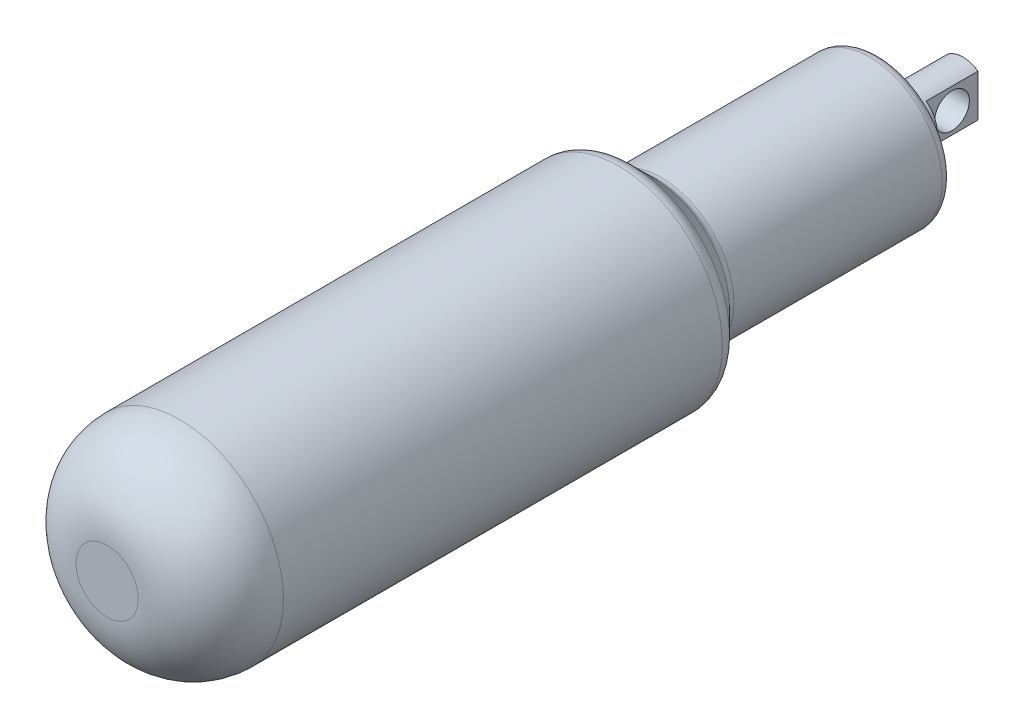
ISO-10303-21;
HEADER;
FILE_DESCRIPTION(('STEP AP214'),'2;1');
FILE_NAME('part.step','',(''),(''),'','','');
FILE_SCHEMA(('AUTOMOTIVE_DESIGN { 1 0 10303 214 1 1 1 1 }'));
ENDSEC;
DATA;
#1=APPLICATION_CONTEXT('core data for automotive mechanical design processes');
#2=APPLICATION_PROTOCOL_DEFINITION('international standard','automotive_design',2000,#1);
#3=PRODUCT_CONTEXT('',#1,'mechanical');
#4=PRODUCT('Part','Part','',(#3));
#5=PRODUCT_RELATED_PRODUCT_CATEGORY('part','',(#4));
#6=PRODUCT_DEFINITION_FORMATION('','',#4);
#7=PRODUCT_DEFINITION_CONTEXT('part definition',#1,'design');
#8=PRODUCT_DEFINITION('design','',#6,#7);
#9=PRODUCT_DEFINITION_SHAPE('','',#8);
#10=(LENGTH_UNIT() NAMED_UNIT(*) SI_UNIT(.MILLI.,.METRE.));
#11=(NAMED_UNIT(*) PLANE_ANGLE_UNIT() SI_UNIT($,.RADIAN.));
#12=(NAMED_UNIT(*) SI_UNIT($,.STERADIAN.) SOLID_ANGLE_UNIT());
#13=UNCERTAINTY_MEASURE_WITH_UNIT(LENGTH_MEASURE(1.E-05),#10,'distance_accuracy_value','');
#14=(GEOMETRIC_REPRESENTATION_CONTEXT(3) GLOBAL_UNCERTAINTY_ASSIGNED_CONTEXT((#13)) GLOBAL_UNIT_ASSIGNED_CONTEXT((#10,
#11,#12)) REPRESENTATION_CONTEXT('',''));
#15=CARTESIAN_POINT('',(0.,0.,0.));
#16=DIRECTION('',(0.,0.,1.));
#17=DIRECTION('',(1.,0.,0.));
#18=AXIS2_PLACEMENT_3D('',#15,#16,#17);
#19=CARTESIAN_POINT('',(0.,0.,-2.999994));
#20=DIRECTION('',(0.,0.,1.));
#21=DIRECTION('',(1.,0.,0.));
#22=AXIS2_PLACEMENT_3D('',#19,#20,#21);
#23=CYLINDRICAL_SURFACE('',#22,2.99999997);
#24=CARTESIAN_POINT('',(0.,0.,6.600006));
#25=DIRECTION('',(0.,0.,1.));
#26=DIRECTION('',(1.,0.,0.));
#27=AXIS2_PLACEMENT_3D('',#24,#25,#26);
#28=CIRCLE('',#27,2.99999997);
#29=CARTESIAN_POINT('',(2.99999997,0.,6.600006));
#30=VERTEX_POINT('',#29);
#31=EDGE_CURVE('E99',#30,#30,#28,.T.);
#32=ORIENTED_EDGE('',*,*,#31,.F.);
#33=EDGE_LOOP('',(#32));
#34=FACE_BOUND('',#33,.T.);
#35=DIRECTION('',(0.,0.,1.));
#36=VECTOR('',#35,1.);
#37=CARTESIAN_POINT('',(-1.7322836,-2.4493250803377,-2.999994));
#38=LINE('',#37,#36);
#39=CARTESIAN_POINT('',(-1.7322836,-2.4493250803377,-2.999994));
#40=VERTEX_POINT('',#39);
#41=CARTESIAN_POINT('',(-1.7322836,-2.4493250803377,3.00000438));
#42=VERTEX_POINT('',#41);
#43=EDGE_CURVE('E105',#40,#42,#38,.T.);
#44=ORIENTED_EDGE('',*,*,#43,.F.);
#45=CARTESIAN_POINT('',(0.,0.,-2.999994));
#46=DIRECTION('',(0.,0.,1.));
#47=DIRECTION('',(1.,0.,0.));
#48=AXIS2_PLACEMENT_3D('',#45,#46,#47);
#49=CIRCLE('',#48,2.99999997);
#50=CARTESIAN_POINT('',(1.7322836,-2.4493250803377,-2.999994));
#51=VERTEX_POINT('',#50);
#52=EDGE_CURVE('E104',#40,#51,#49,.T.);
#53=ORIENTED_EDGE('',*,*,#52,.T.);
#54=DIRECTION('',(0.,0.,1.));
#55=VECTOR('',#54,1.);
#56=CARTESIAN_POINT('',(1.7322836,-2.4493250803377,-2.999994));
#57=LINE('',#56,#55);
#58=CARTESIAN_POINT('',(1.7322836,-2.4493250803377,3.00000438));
#59=VERTEX_POINT('',#58);
#60=EDGE_CURVE('E29',#59,#51,#57,.F.);
#61=ORIENTED_EDGE('',*,*,#60,.F.);
#62=CARTESIAN_POINT('',(0.,0.,3.00000438));
#63=DIRECTION('',(0.,0.,-1.));
#64=DIRECTION('',(-1.,0.,0.));
#65=AXIS2_PLACEMENT_3D('',#62,#63,#64);
#66=CIRCLE('',#65,2.99999997);
#67=CARTESIAN_POINT('',(1.7322836,2.4493250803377,3.00000438));
#68=VERTEX_POINT('',#67);
#69=EDGE_CURVE('E22',#68,#59,#66,.T.);
#70=ORIENTED_EDGE('',*,*,#69,.F.);
#71=DIRECTION('',(0.,0.,1.));
#72=VECTOR('',#71,1.);
#73=CARTESIAN_POINT('',(1.7322836,2.4493250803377,-2.999994));
#74=LINE('',#73,#72);
#75=CARTESIAN_POINT('',(1.7322836,2.4493250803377,-2.999994));
#76=VERTEX_POINT('',#75);
#77=EDGE_CURVE('E54',#76,#68,#74,.T.);
#78=ORIENTED_EDGE('',*,*,#77,.F.);
#79=CARTESIAN_POINT('',(-1.7322836,2.4493250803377,-2.999994));
#80=VERTEX_POINT('',#79);
#81=EDGE_CURVE('E102',#76,#80,#49,.T.);
#82=ORIENTED_EDGE('',*,*,#81,.T.);
#83=DIRECTION('',(0.,0.,1.));
#84=VECTOR('',#83,1.);
#85=CARTESIAN_POINT('',(-1.7322836,2.4493250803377,-2.999994));
#86=LINE('',#85,#84);
#87=CARTESIAN_POINT('',(-1.7322836,2.4493250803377,3.00000438));
#88=VERTEX_POINT('',#87);
#89=EDGE_CURVE('E37',#88,#80,#86,.F.);
#90=ORIENTED_EDGE('',*,*,#89,.F.);
#91=CARTESIAN_POINT('',(0.,0.,3.00000438));
#92=DIRECTION('',(0.,0.,-1.));
#93=DIRECTION('',(-1.,0.,0.));
#94=AXIS2_PLACEMENT_3D('',#91,#92,#93);
#95=CIRCLE('',#94,2.99999997);
#96=EDGE_CURVE('E9',#42,#88,#95,.T.);
#97=ORIENTED_EDGE('',*,*,#96,.F.);
#98=EDGE_LOOP('',(#44,#53,#61,#70,#78,#82,#90,#97));
#99=FACE_BOUND('',#98,.T.);
#100=ADVANCED_FACE('F14',(#34,#99),#23,.T.);
#101=CARTESIAN_POINT('',(0.,2.99999997,-2.999994));
#102=DIRECTION('',(0.,0.,1.));
#103=DIRECTION('',(1.,0.,0.));
#104=AXIS2_PLACEMENT_3D('',#101,#102,#103);
#105=PLANE('',#104);
#106=DIRECTION('',(0.,-1.,0.));
#107=VECTOR('',#106,1.);
#108=CARTESIAN_POINT('',(-1.7322836,2.99999997,-2.999994));
#109=LINE('',#108,#107);
#110=EDGE_CURVE('E71',#80,#40,#109,.T.);
#111=ORIENTED_EDGE('',*,*,#110,.F.);
#112=ORIENTED_EDGE('',*,*,#81,.F.);
#113=DIRECTION('',(0.,1.,0.));
#114=VECTOR('',#113,1.);
#115=CARTESIAN_POINT('',(1.7322836,2.99999997,-2.999994));
#116=LINE('',#115,#114);
#117=EDGE_CURVE('E58',#51,#76,#116,.T.);
#118=ORIENTED_EDGE('',*,*,#117,.F.);
#119=ORIENTED_EDGE('',*,*,#52,.F.);
#120=EDGE_LOOP('',(#111,#112,#118,#119));
#121=FACE_BOUND('',#120,.T.);
#122=ADVANCED_FACE('F127',(#121),#105,.F.);
#123=CARTESIAN_POINT('',(0.,0.,96.00000324));
#124=DIRECTION('',(0.,0.,-1.));
#125=DIRECTION('',(-1.,0.,0.));
#126=AXIS2_PLACEMENT_3D('',#123,#124,#125);
#127=PLANE('',#126);
#128=CARTESIAN_POINT('',(0.,0.,96.00000324));
#129=DIRECTION('',(0.,0.,1.));
#130=DIRECTION('',(1.,0.,0.));
#131=AXIS2_PLACEMENT_3D('',#128,#129,#130);
#132=CIRCLE('',#131,3.600000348);
#133=CARTESIAN_POINT('',(3.600000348,0.,96.00000324));
#134=VERTEX_POINT('',#133);
#135=EDGE_CURVE('E75',#134,#134,#132,.T.);
#136=ORIENTED_EDGE('',*,*,#135,.T.);
#137=EDGE_LOOP('',(#136));
#138=FACE_BOUND('',#137,.T.);
#139=ADVANCED_FACE('F16',(#138),#127,.F.);
#140=CARTESIAN_POINT('',(0.,0.,87.600003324));
#141=DIRECTION('',(0.,0.,1.));
#142=DIRECTION('',(1.,0.,0.));
#143=AXIS2_PLACEMENT_3D('',#140,#141,#142);
#144=DEGENERATE_TOROIDAL_SURFACE('',#143,3.60000034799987,8.39999991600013,.T.);
#145=ORIENTED_EDGE('',*,*,#135,.F.);
#146=EDGE_LOOP('',(#145));
#147=FACE_BOUND('',#146,.T.);
#148=CARTESIAN_POINT('',(0.,0.,87.600003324));
#149=DIRECTION('',(0.,0.,1.));
#150=DIRECTION('',(1.,0.,0.));
#151=AXIS2_PLACEMENT_3D('',#148,#149,#150);
#152=CIRCLE('',#151,12.000000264);
#153=CARTESIAN_POINT('',(12.000000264,0.,87.600003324));
#154=VERTEX_POINT('',#153);
#155=EDGE_CURVE('E78',#154,#154,#152,.T.);
#156=ORIENTED_EDGE('',*,*,#155,.T.);
#157=EDGE_LOOP('',(#156));
#158=FACE_BOUND('',#157,.T.);
#159=ADVANCED_FACE('F136',(#147,#158),#144,.T.);
#160=CARTESIAN_POINT('',(0.,0.,-2.999994));
#161=DIRECTION('',(0.,0.,1.));
#162=DIRECTION('',(1.,0.,0.));
#163=AXIS2_PLACEMENT_3D('',#160,#161,#162);
#164=CYLINDRICAL_SURFACE('',#163,12.000000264);
#165=ORIENTED_EDGE('',*,*,#155,.F.);
#166=EDGE_LOOP('',(#165));
#167=FACE_BOUND('',#166,.T.);
#168=CARTESIAN_POINT('',(0.,0.,36.828430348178));
#169=DIRECTION('',(0.,0.,1.));
#170=DIRECTION('',(1.,0.,0.));
#171=AXIS2_PLACEMENT_3D('',#168,#169,#170);
#172=CIRCLE('',#171,12.000000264);
#173=CARTESIAN_POINT('',(12.000000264,0.,36.828430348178));
#174=VERTEX_POINT('',#173);
#175=EDGE_CURVE('E81',#174,#174,#172,.T.);
#176=ORIENTED_EDGE('',*,*,#175,.T.);
#177=EDGE_LOOP('',(#176));
#178=FACE_BOUND('',#177,.T.);
#179=ADVANCED_FACE('F165',(#167,#178),#164,.T.);
#180=CARTESIAN_POINT('',(0.,0.,36.8284303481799));
#181=DIRECTION('',(0.,0.,1.));
#182=DIRECTION('',(1.,0.,0.));
#183=AXIS2_PLACEMENT_3D('',#180,#181,#182);
#184=TOROIDAL_SURFACE('',#183,10.0000003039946,1.99999996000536);
#185=ORIENTED_EDGE('',*,*,#175,.F.);
#186=EDGE_LOOP('',(#185));
#187=FACE_BOUND('',#186,.T.);
#188=CARTESIAN_POINT('',(0.,0.,35.414216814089));
#189=DIRECTION('',(0.,0.,1.));
#190=DIRECTION('',(1.,0.,0.));
#191=AXIS2_PLACEMENT_3D('',#188,#189,#190);
#192=CIRCLE('',#191,11.414213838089);
#193=CARTESIAN_POINT('',(11.414213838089,0.,35.414216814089));
#194=VERTEX_POINT('',#193);
#195=EDGE_CURVE('E84',#194,#194,#192,.T.);
#196=ORIENTED_EDGE('',*,*,#195,.T.);
#197=EDGE_LOOP('',(#196));
#198=FACE_BOUND('',#197,.T.);
#199=ADVANCED_FACE('F161',(#187,#198),#184,.T.);
#200=CARTESIAN_POINT('',(0.,0.,32.751474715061));
#201=DIRECTION('',(0.,0.,1.));
#202=DIRECTION('',(1.,0.,0.));
#203=AXIS2_PLACEMENT_3D('',#200,#201,#202);
#204=CONICAL_SURFACE('',#203,8.751471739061,0.785398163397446);
#205=ORIENTED_EDGE('',*,*,#195,.F.);
#206=EDGE_LOOP('',(#205));
#207=FACE_BOUND('',#206,.T.);
#208=CARTESIAN_POINT('',(0.,0.,32.751474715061));
#209=DIRECTION('',(0.,0.,1.));
#210=DIRECTION('',(1.,0.,0.));
#211=AXIS2_PLACEMENT_3D('',#208,#209,#210);
#212=CIRCLE('',#211,8.751471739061);
#213=CARTESIAN_POINT('',(8.751471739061,0.,32.751474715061));
#214=VERTEX_POINT('',#213);
#215=EDGE_CURVE('E87',#214,#214,#212,.T.);
#216=ORIENTED_EDGE('',*,*,#215,.T.);
#217=EDGE_LOOP('',(#216));
#218=FACE_BOUND('',#217,.T.);
#219=ADVANCED_FACE('F157',(#207,#218),#204,.T.);
#220=CARTESIAN_POINT('',(0.,0.,31.9029465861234));
#221=DIRECTION('',(0.,0.,1.));
#222=DIRECTION('',(1.,0.,0.));
#223=AXIS2_PLACEMENT_3D('',#220,#221,#222);
#224=TOROIDAL_SURFACE('',#223,9.59999986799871,1.19999998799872);
#225=ORIENTED_EDGE('',*,*,#215,.F.);
#226=EDGE_LOOP('',(#225));
#227=FACE_BOUND('',#226,.T.);
#228=CARTESIAN_POINT('',(0.,0.,31.902946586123));
#229=DIRECTION('',(0.,0.,1.));
#230=DIRECTION('',(1.,0.,0.));
#231=AXIS2_PLACEMENT_3D('',#228,#229,#230);
#232=CIRCLE('',#231,8.39999988);
#233=CARTESIAN_POINT('',(8.39999988,0.,31.902946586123));
#234=VERTEX_POINT('',#233);
#235=EDGE_CURVE('E90',#234,#234,#232,.T.);
#236=ORIENTED_EDGE('',*,*,#235,.T.);
#237=EDGE_LOOP('',(#236));
#238=FACE_BOUND('',#237,.T.);
#239=ADVANCED_FACE('F153',(#227,#238),#224,.F.);
#240=CARTESIAN_POINT('',(0.,0.,-2.999994));
#241=DIRECTION('',(0.,0.,1.));
#242=DIRECTION('',(1.,0.,0.));
#243=AXIS2_PLACEMENT_3D('',#240,#241,#242);
#244=CYLINDRICAL_SURFACE('',#243,8.39999988);
#245=ORIENTED_EDGE('',*,*,#235,.F.);
#246=EDGE_LOOP('',(#245));
#247=FACE_BOUND('',#246,.T.);
#248=CARTESIAN_POINT('',(0.,0.,7.80000598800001));
#249=DIRECTION('',(0.,0.,1.));
#250=DIRECTION('',(1.,0.,0.));
#251=AXIS2_PLACEMENT_3D('',#248,#249,#250);
#252=CIRCLE('',#251,8.39999988);
#253=CARTESIAN_POINT('',(8.39999988,0.,7.80000598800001));
#254=VERTEX_POINT('',#253);
#255=EDGE_CURVE('E93',#254,#254,#252,.T.);
#256=ORIENTED_EDGE('',*,*,#255,.T.);
#257=EDGE_LOOP('',(#256));
#258=FACE_BOUND('',#257,.T.);
#259=ADVANCED_FACE('F149',(#247,#258),#244,.T.);
#260=CARTESIAN_POINT('',(0.,0.,7.80000598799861));
#261=DIRECTION('',(0.,0.,1.));
#262=DIRECTION('',(1.,0.,0.));
#263=AXIS2_PLACEMENT_3D('',#260,#261,#262);
#264=TOROIDAL_SURFACE('',#263,7.19999989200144,1.19999998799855);
#265=ORIENTED_EDGE('',*,*,#255,.F.);
#266=EDGE_LOOP('',(#265));
#267=FACE_BOUND('',#266,.T.);
#268=CARTESIAN_POINT('',(0.,0.,6.600006));
#269=DIRECTION('',(0.,0.,1.));
#270=DIRECTION('',(1.,0.,0.));
#271=AXIS2_PLACEMENT_3D('',#268,#269,#270);
#272=CIRCLE('',#271,7.199999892);
#273=CARTESIAN_POINT('',(7.199999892,0.,6.600006));
#274=VERTEX_POINT('',#273);
#275=EDGE_CURVE('E96',#274,#274,#272,.T.);
#276=ORIENTED_EDGE('',*,*,#275,.T.);
#277=EDGE_LOOP('',(#276));
#278=FACE_BOUND('',#277,.T.);
#279=ADVANCED_FACE('F145',(#267,#278),#264,.T.);
#280=CARTESIAN_POINT('',(0.,7.199999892,6.600006));
#281=DIRECTION('',(0.,0.,1.));
#282=DIRECTION('',(1.,0.,0.));
#283=AXIS2_PLACEMENT_3D('',#280,#281,#282);
#284=PLANE('',#283);
#285=ORIENTED_EDGE('',*,*,#275,.F.);
#286=EDGE_LOOP('',(#285));
#287=FACE_BOUND('',#286,.T.);
#288=ORIENTED_EDGE('',*,*,#31,.T.);
#289=EDGE_LOOP('',(#288));
#290=FACE_BOUND('',#289,.T.);
#291=ADVANCED_FACE('F142',(#287,#290),#284,.F.);
#292=CARTESIAN_POINT('',(1.7322836,40.,-5.49199562));
#293=DIRECTION('',(1.,0.,0.));
#294=DIRECTION('',(0.,1.,0.));
#295=AXIS2_PLACEMENT_3D('',#292,#293,#294);
#296=PLANE('',#295);
#297=CARTESIAN_POINT('',(1.7322836,0.,0.));
#298=DIRECTION('',(1.,0.,0.));
#299=DIRECTION('',(0.,1.,0.));
#300=AXIS2_PLACEMENT_3D('',#297,#298,#299);
#301=CIRCLE('',#300,2.);
#302=CARTESIAN_POINT('',(1.7322836,2.,0.));
#303=VERTEX_POINT('',#302);
#304=EDGE_CURVE('E67',#303,#303,#301,.T.);
#305=ORIENTED_EDGE('',*,*,#304,.F.);
#306=EDGE_LOOP('',(#305));
#307=FACE_BOUND('',#306,.T.);
#308=ORIENTED_EDGE('',*,*,#77,.T.);
#309=DIRECTION('',(0.,-1.,0.));
#310=VECTOR('',#309,1.);
#311=CARTESIAN_POINT('',(1.7322836,40.,3.00000438));
#312=LINE('',#311,#310);
#313=EDGE_CURVE('E57',#68,#59,#312,.T.);
#314=ORIENTED_EDGE('',*,*,#313,.T.);
#315=ORIENTED_EDGE('',*,*,#60,.T.);
#316=ORIENTED_EDGE('',*,*,#117,.T.);
#317=EDGE_LOOP('',(#308,#314,#315,#316));
#318=FACE_BOUND('',#317,.T.);
#319=ADVANCED_FACE('F56',(#307,#318),#296,.T.);
#320=CARTESIAN_POINT('',(1.7322836,40.,3.00000438));
#321=DIRECTION('',(0.,0.,-1.));
#322=DIRECTION('',(-1.,0.,0.));
#323=AXIS2_PLACEMENT_3D('',#320,#321,#322);
#324=PLANE('',#323);
#325=ORIENTED_EDGE('',*,*,#69,.T.);
#326=ORIENTED_EDGE('',*,*,#313,.F.);
#327=EDGE_LOOP('',(#325,#326));
#328=FACE_BOUND('',#327,.T.);
#329=ADVANCED_FACE('F65',(#328),#324,.T.);
#330=CARTESIAN_POINT('',(-4.2722836,40.,3.00000438));
#331=DIRECTION('',(0.,0.,-1.));
#332=DIRECTION('',(-1.,0.,0.));
#333=AXIS2_PLACEMENT_3D('',#330,#331,#332);
#334=PLANE('',#333);
#335=ORIENTED_EDGE('',*,*,#96,.T.);
#336=DIRECTION('',(0.,-1.,0.));
#337=VECTOR('',#336,1.);
#338=CARTESIAN_POINT('',(-1.7322836,40.,3.00000438));
#339=LINE('',#338,#337);
#340=EDGE_CURVE('E66',#88,#42,#339,.T.);
#341=ORIENTED_EDGE('',*,*,#340,.T.);
#342=EDGE_LOOP('',(#335,#341));
#343=FACE_BOUND('',#342,.T.);
#344=ADVANCED_FACE('F121',(#343),#334,.T.);
#345=CARTESIAN_POINT('',(-1.7322836,40.,3.00000438));
#346=DIRECTION('',(-1.,0.,0.));
#347=DIRECTION('',(0.,-1.,0.));
#348=AXIS2_PLACEMENT_3D('',#345,#346,#347);
#349=PLANE('',#348);
#350=CARTESIAN_POINT('',(-1.7322836,0.,0.));
#351=DIRECTION('',(-1.,0.,0.));
#352=DIRECTION('',(0.,-1.,0.));
#353=AXIS2_PLACEMENT_3D('',#350,#351,#352);
#354=CIRCLE('',#353,2.);
#355=CARTESIAN_POINT('',(-1.7322836,-2.,0.));
#356=VERTEX_POINT('',#355);
#357=EDGE_CURVE('E113',#356,#356,#354,.T.);
#358=ORIENTED_EDGE('',*,*,#357,.F.);
#359=EDGE_LOOP('',(#358));
#360=FACE_BOUND('',#359,.T.);
#361=ORIENTED_EDGE('',*,*,#43,.T.);
#362=ORIENTED_EDGE('',*,*,#340,.F.);
#363=ORIENTED_EDGE('',*,*,#89,.T.);
#364=ORIENTED_EDGE('',*,*,#110,.T.);
#365=EDGE_LOOP('',(#361,#362,#363,#364));
#366=FACE_BOUND('',#365,.T.);
#367=ADVANCED_FACE('F119',(#360,#366),#349,.T.);
#368=CARTESIAN_POINT('',(8.2677164,0.,0.));
#369=DIRECTION('',(-1.,0.,0.));
#370=DIRECTION('',(0.,-1.,0.));
#371=AXIS2_PLACEMENT_3D('',#368,#369,#370);
#372=CYLINDRICAL_SURFACE('',#371,2.);
#373=ORIENTED_EDGE('',*,*,#304,.T.);
#374=EDGE_LOOP('',(#373));
#375=FACE_BOUND('',#374,.T.);
#376=ORIENTED_EDGE('',*,*,#357,.T.);
#377=EDGE_LOOP('',(#376));
#378=FACE_BOUND('',#377,.T.);
#379=ADVANCED_FACE('F117',(#375,#378),#372,.F.);
#380=CLOSED_SHELL('',(#100,#122,#139,#159,#179,#199,#219,#239,#259,#279,#291,#319,#329,#344,
#367,#379));
#381=MANIFOLD_SOLID_BREP('B1',#380);
#382=ADVANCED_BREP_SHAPE_REPRESENTATION('',(#18,#381),#14);
#383=SHAPE_DEFINITION_REPRESENTATION(#9,#382);
ENDSEC;
END-ISO-10303-21;
